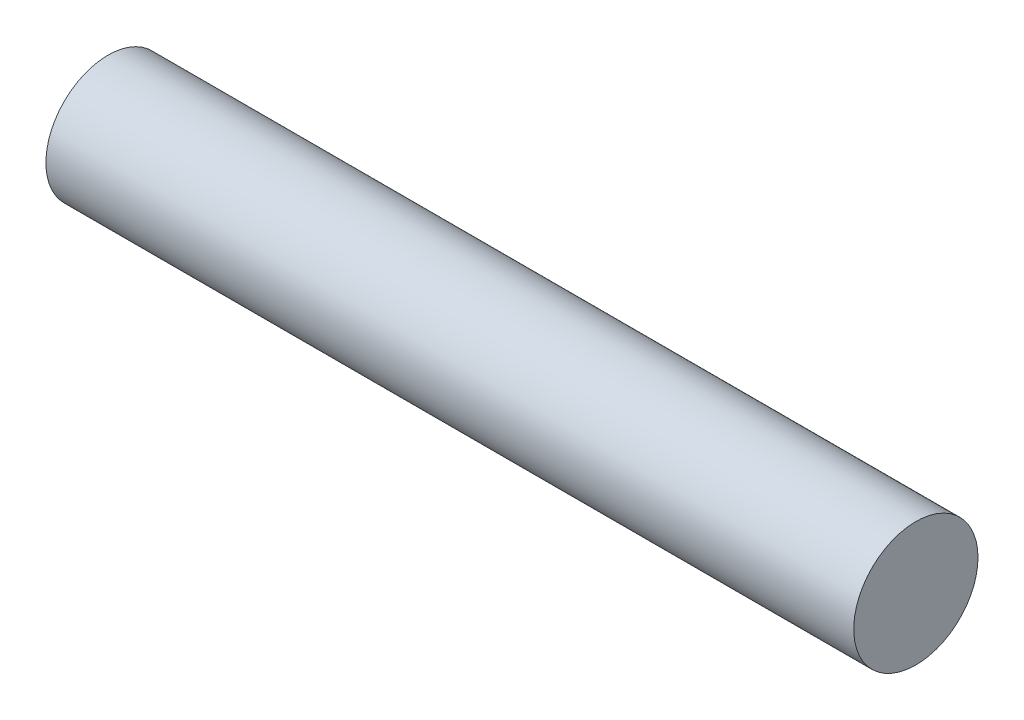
ISO-10303-21;
HEADER;
FILE_DESCRIPTION(('STEP AP214'),'2;1');
FILE_NAME('part.step','',(''),(''),'','','');
FILE_SCHEMA(('AUTOMOTIVE_DESIGN { 1 0 10303 214 1 1 1 1 }'));
ENDSEC;
DATA;
#1=APPLICATION_CONTEXT('core data for automotive mechanical design processes');
#2=APPLICATION_PROTOCOL_DEFINITION('international standard','automotive_design',2000,#1);
#3=PRODUCT_CONTEXT('',#1,'mechanical');
#4=PRODUCT('Part','Part','',(#3));
#5=PRODUCT_RELATED_PRODUCT_CATEGORY('part','',(#4));
#6=PRODUCT_DEFINITION_FORMATION('','',#4);
#7=PRODUCT_DEFINITION_CONTEXT('part definition',#1,'design');
#8=PRODUCT_DEFINITION('design','',#6,#7);
#9=PRODUCT_DEFINITION_SHAPE('','',#8);
#10=(LENGTH_UNIT() NAMED_UNIT(*) SI_UNIT(.MILLI.,.METRE.));
#11=(NAMED_UNIT(*) PLANE_ANGLE_UNIT() SI_UNIT($,.RADIAN.));
#12=(NAMED_UNIT(*) SI_UNIT($,.STERADIAN.) SOLID_ANGLE_UNIT());
#13=UNCERTAINTY_MEASURE_WITH_UNIT(LENGTH_MEASURE(1.E-05),#10,'distance_accuracy_value','');
#14=(GEOMETRIC_REPRESENTATION_CONTEXT(3) GLOBAL_UNCERTAINTY_ASSIGNED_CONTEXT((#13)) GLOBAL_UNIT_ASSIGNED_CONTEXT((#10,
#11,#12)) REPRESENTATION_CONTEXT('',''));
#15=CARTESIAN_POINT('',(0.,0.,0.));
#16=DIRECTION('',(0.,0.,1.));
#17=DIRECTION('',(1.,0.,0.));
#18=AXIS2_PLACEMENT_3D('',#15,#16,#17);
#19=CARTESIAN_POINT('',(-13.,0.,0.));
#20=DIRECTION('',(1.,0.,0.));
#21=DIRECTION('',(0.,0.,-1.));
#22=AXIS2_PLACEMENT_3D('',#19,#20,#21);
#23=CYLINDRICAL_SURFACE('',#22,2.);
#24=CARTESIAN_POINT('',(-13.,0.,0.));
#25=DIRECTION('',(1.,0.,0.));
#26=DIRECTION('',(0.,0.,-1.));
#27=AXIS2_PLACEMENT_3D('',#24,#25,#26);
#28=CIRCLE('',#27,2.);
#29=CARTESIAN_POINT('',(-13.,0.,-2.));
#30=VERTEX_POINT('',#29);
#31=EDGE_CURVE('E10',#30,#30,#28,.T.);
#32=CARTESIAN_POINT('',(13.,0.,0.));
#33=DIRECTION('',(1.,0.,0.));
#34=DIRECTION('',(0.,0.,-1.));
#35=AXIS2_PLACEMENT_3D('',#32,#33,#34);
#36=CIRCLE('',#35,2.);
#37=CARTESIAN_POINT('',(13.,0.,-2.));
#38=VERTEX_POINT('',#37);
#39=EDGE_CURVE('E40',#38,#38,#36,.T.);
#40=CARTESIAN_POINT('',(-13.,0.,-2.));
#41=CARTESIAN_POINT('',(-12.7291666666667,0.,-2.));
#42=CARTESIAN_POINT('',(-12.4583333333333,0.,-2.));
#43=CARTESIAN_POINT('',(-11.9166666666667,0.,-2.));
#44=CARTESIAN_POINT('',(-11.6458333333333,0.,-2.));
#45=CARTESIAN_POINT('',(-11.1041666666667,0.,-2.));
#46=CARTESIAN_POINT('',(-10.8333333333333,0.,-2.));
#47=CARTESIAN_POINT('',(-10.2916666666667,0.,-2.));
#48=CARTESIAN_POINT('',(-10.0208333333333,0.,-2.));
#49=CARTESIAN_POINT('',(-9.47916666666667,0.,-2.));
#50=CARTESIAN_POINT('',(-9.20833333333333,0.,-2.));
#51=CARTESIAN_POINT('',(-8.66666666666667,0.,-2.));
#52=CARTESIAN_POINT('',(-8.39583333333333,0.,-2.));
#53=CARTESIAN_POINT('',(-7.85416666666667,0.,-2.));
#54=CARTESIAN_POINT('',(-7.58333333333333,0.,-2.));
#55=CARTESIAN_POINT('',(-7.04166666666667,0.,-2.));
#56=CARTESIAN_POINT('',(-6.77083333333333,0.,-2.));
#57=CARTESIAN_POINT('',(-6.22916666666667,0.,-2.));
#58=CARTESIAN_POINT('',(-5.95833333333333,0.,-2.));
#59=CARTESIAN_POINT('',(-5.41666666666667,0.,-2.));
#60=CARTESIAN_POINT('',(-5.14583333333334,0.,-2.));
#61=CARTESIAN_POINT('',(-4.60416666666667,0.,-2.));
#62=CARTESIAN_POINT('',(-4.33333333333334,0.,-2.));
#63=CARTESIAN_POINT('',(-3.79166666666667,0.,-2.));
#64=CARTESIAN_POINT('',(-3.52083333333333,0.,-2.));
#65=CARTESIAN_POINT('',(-2.97916666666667,0.,-2.));
#66=CARTESIAN_POINT('',(-2.70833333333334,0.,-2.));
#67=CARTESIAN_POINT('',(-2.16666666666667,0.,-2.));
#68=CARTESIAN_POINT('',(-1.89583333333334,0.,-2.));
#69=CARTESIAN_POINT('',(-1.35416666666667,0.,-2.));
#70=CARTESIAN_POINT('',(-1.08333333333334,0.,-2.));
#71=CARTESIAN_POINT('',(-0.541666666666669,0.,-2.));
#72=CARTESIAN_POINT('',(-0.270833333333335,0.,-2.));
#73=CARTESIAN_POINT('',(0.270833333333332,0.,-2.));
#74=CARTESIAN_POINT('',(0.541666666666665,0.,-2.));
#75=CARTESIAN_POINT('',(1.08333333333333,0.,-2.));
#76=CARTESIAN_POINT('',(1.35416666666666,0.,-2.));
#77=CARTESIAN_POINT('',(1.89583333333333,0.,-2.));
#78=CARTESIAN_POINT('',(2.16666666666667,0.,-2.));
#79=CARTESIAN_POINT('',(2.70833333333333,0.,-2.));
#80=CARTESIAN_POINT('',(2.97916666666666,0.,-2.));
#81=CARTESIAN_POINT('',(3.52083333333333,0.,-2.));
#82=CARTESIAN_POINT('',(3.79166666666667,0.,-2.));
#83=CARTESIAN_POINT('',(4.33333333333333,0.,-2.));
#84=CARTESIAN_POINT('',(4.60416666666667,0.,-2.));
#85=CARTESIAN_POINT('',(5.14583333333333,0.,-2.));
#86=CARTESIAN_POINT('',(5.41666666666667,0.,-2.));
#87=CARTESIAN_POINT('',(5.95833333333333,0.,-2.));
#88=CARTESIAN_POINT('',(6.22916666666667,0.,-2.));
#89=CARTESIAN_POINT('',(6.77083333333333,0.,-2.));
#90=CARTESIAN_POINT('',(7.04166666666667,0.,-2.));
#91=CARTESIAN_POINT('',(7.58333333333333,0.,-2.));
#92=CARTESIAN_POINT('',(7.85416666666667,0.,-2.));
#93=CARTESIAN_POINT('',(8.39583333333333,0.,-2.));
#94=CARTESIAN_POINT('',(8.66666666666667,0.,-2.));
#95=CARTESIAN_POINT('',(9.20833333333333,0.,-2.));
#96=CARTESIAN_POINT('',(9.47916666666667,0.,-2.));
#97=CARTESIAN_POINT('',(10.0208333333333,0.,-2.));
#98=CARTESIAN_POINT('',(10.2916666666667,0.,-2.));
#99=CARTESIAN_POINT('',(10.8333333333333,0.,-2.));
#100=CARTESIAN_POINT('',(11.1041666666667,0.,-2.));
#101=CARTESIAN_POINT('',(11.6458333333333,0.,-2.));
#102=CARTESIAN_POINT('',(11.9166666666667,0.,-2.));
#103=CARTESIAN_POINT('',(12.4583333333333,0.,-2.));
#104=CARTESIAN_POINT('',(12.7291666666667,0.,-2.));
#105=CARTESIAN_POINT('',(13.,0.,-2.));
#106=B_SPLINE_CURVE_WITH_KNOTS('',3,(#40,#41,#42,#43,#44,#45,#46,#47,#48,#49,#50,#51,#52,#53,
#54,#55,#56,#57,#58,#59,#60,#61,#62,#63,#64,#65,#66,#67,#68,#69,#70,#71,#72,#73,#74,#75,#76,#77,
#78,#79,#80,#81,#82,#83,#84,#85,#86,#87,#88,#89,#90,#91,#92,#93,#94,#95,#96,#97,#98,#99,#100,
#101,#102,#103,#104,#105),.UNSPECIFIED.,.F.,.F.,(4,2,2,2,2,2,2,2,2,2,2,2,2,2,2,2,2,2,2,2,2,2,2,
2,2,2,2,2,2,2,2,2,4),(0.,0.812500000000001,1.625,2.4375,3.25,4.0625,4.875,5.6875,6.5,7.3125,
8.125,8.9375,9.75,10.5625,11.375,12.1875,13.,13.8125,14.625,15.4375,16.25,17.0625,17.875,
18.6875,19.5,20.3125,21.125,21.9375,22.75,23.5625,24.375,25.1875,26.),.UNSPECIFIED.);
#107=EDGE_CURVE('BSEAM37',#30,#38,#106,.T.);
#108=ORIENTED_EDGE('',*,*,#31,.T.);
#109=ORIENTED_EDGE('',*,*,#39,.F.);
#110=ORIENTED_EDGE('',*,*,#107,.T.);
#111=ORIENTED_EDGE('',*,*,#107,.F.);
#112=EDGE_LOOP('',(#108,#110,#109,#111));
#113=FACE_BOUND('',#112,.T.);
#114=ADVANCED_FACE('F37',(#113),#23,.T.);
#115=CARTESIAN_POINT('',(-13.,0.,0.));
#116=DIRECTION('',(1.,0.,0.));
#117=DIRECTION('',(0.,0.,-1.));
#118=AXIS2_PLACEMENT_3D('',#115,#116,#117);
#119=PLANE('',#118);
#120=ORIENTED_EDGE('',*,*,#31,.F.);
#121=EDGE_LOOP('',(#120));
#122=FACE_BOUND('',#121,.T.);
#123=ADVANCED_FACE('F52',(#122),#119,.F.);
#124=CARTESIAN_POINT('',(13.,0.,0.));
#125=DIRECTION('',(1.,0.,0.));
#126=DIRECTION('',(0.,0.,-1.));
#127=AXIS2_PLACEMENT_3D('',#124,#125,#126);
#128=PLANE('',#127);
#129=ORIENTED_EDGE('',*,*,#39,.T.);
#130=EDGE_LOOP('',(#129));
#131=FACE_BOUND('',#130,.T.);
#132=ADVANCED_FACE('F49',(#131),#128,.T.);
#133=CLOSED_SHELL('',(#114,#123,#132));
#134=MANIFOLD_SOLID_BREP('B2',#133);
#135=ADVANCED_BREP_SHAPE_REPRESENTATION('',(#18,#134),#14);
#136=SHAPE_DEFINITION_REPRESENTATION(#9,#135);
ENDSEC;
END-ISO-10303-21;
